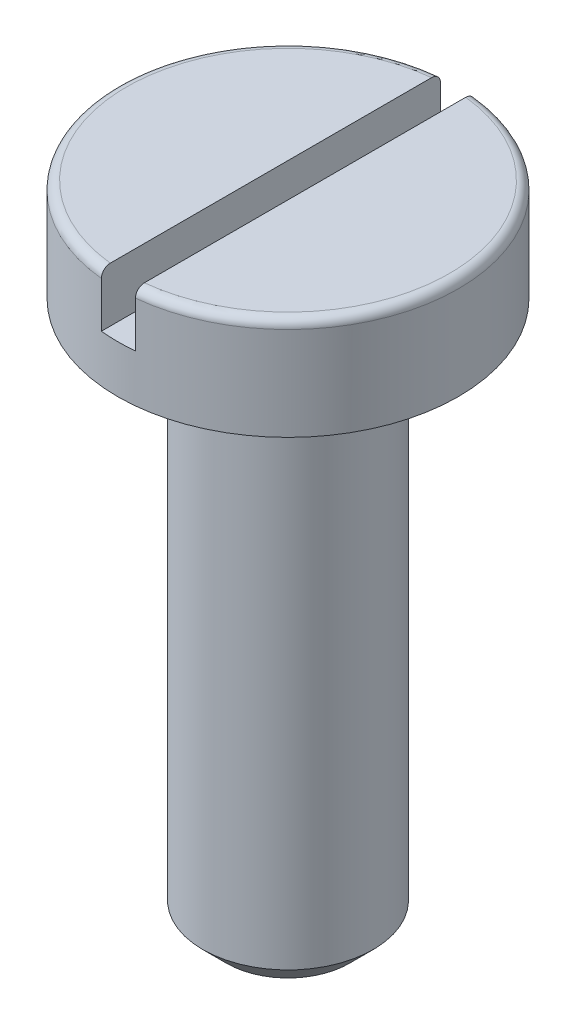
ISO-10303-21;
HEADER;
FILE_DESCRIPTION(('STEP AP214'),'2;1');
FILE_NAME('part.step','',(''),(''),'','','');
FILE_SCHEMA(('AUTOMOTIVE_DESIGN { 1 0 10303 214 1 1 1 1 }'));
ENDSEC;
DATA;
#1=APPLICATION_CONTEXT('core data for automotive mechanical design processes');
#2=APPLICATION_PROTOCOL_DEFINITION('international standard','automotive_design',2000,#1);
#3=PRODUCT_CONTEXT('',#1,'mechanical');
#4=PRODUCT('Part','Part','',(#3));
#5=PRODUCT_RELATED_PRODUCT_CATEGORY('part','',(#4));
#6=PRODUCT_DEFINITION_FORMATION('','',#4);
#7=PRODUCT_DEFINITION_CONTEXT('part definition',#1,'design');
#8=PRODUCT_DEFINITION('design','',#6,#7);
#9=PRODUCT_DEFINITION_SHAPE('','',#8);
#10=(LENGTH_UNIT() NAMED_UNIT(*) SI_UNIT(.MILLI.,.METRE.));
#11=(NAMED_UNIT(*) PLANE_ANGLE_UNIT() SI_UNIT($,.RADIAN.));
#12=(NAMED_UNIT(*) SI_UNIT($,.STERADIAN.) SOLID_ANGLE_UNIT());
#13=UNCERTAINTY_MEASURE_WITH_UNIT(LENGTH_MEASURE(1.E-05),#10,'distance_accuracy_value','');
#14=(GEOMETRIC_REPRESENTATION_CONTEXT(3) GLOBAL_UNCERTAINTY_ASSIGNED_CONTEXT((#13)) GLOBAL_UNIT_ASSIGNED_CONTEXT((#10,
#11,#12)) REPRESENTATION_CONTEXT('',''));
#15=CARTESIAN_POINT('',(0.,0.,0.));
#16=DIRECTION('',(0.,0.,1.));
#17=DIRECTION('',(1.,0.,0.));
#18=AXIS2_PLACEMENT_3D('',#15,#16,#17);
#19=CARTESIAN_POINT('',(0.,1.5,0.));
#20=DIRECTION('',(0.,-1.,0.));
#21=DIRECTION('',(0.,0.,-1.));
#22=AXIS2_PLACEMENT_3D('',#19,#20,#21);
#23=PLANE('',#22);
#24=CARTESIAN_POINT('',(0.,1.5,0.));
#25=DIRECTION('',(0.,1.,0.));
#26=DIRECTION('',(0.,0.,1.));
#27=AXIS2_PLACEMENT_3D('',#24,#25,#26);
#28=CIRCLE('',#27,2.37);
#29=CARTESIAN_POINT('',(-0.25,1.5,-2.35677746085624));
#30=VERTEX_POINT('',#29);
#31=CARTESIAN_POINT('',(-0.25,1.5,2.35677746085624));
#32=VERTEX_POINT('',#31);
#33=EDGE_CURVE('E96',#30,#32,#28,.T.);
#34=ORIENTED_EDGE('',*,*,#33,.T.);
#35=DIRECTION('',(0.,0.,1.));
#36=VECTOR('',#35,1.);
#37=CARTESIAN_POINT('',(-0.25,1.5,-2.5));
#38=LINE('',#37,#36);
#39=EDGE_CURVE('E87',#30,#32,#38,.T.);
#40=ORIENTED_EDGE('',*,*,#39,.F.);
#41=EDGE_LOOP('',(#34,#40));
#42=FACE_BOUND('',#41,.T.);
#43=ADVANCED_FACE('F33',(#42),#23,.F.);
#44=CARTESIAN_POINT('',(0.,1.37,0.));
#45=DIRECTION('',(0.,1.,0.));
#46=DIRECTION('',(0.,0.,1.));
#47=AXIS2_PLACEMENT_3D('',#44,#45,#46);
#48=TOROIDAL_SURFACE('',#47,2.37,0.13);
#49=ORIENTED_EDGE('',*,*,#33,.F.);
#50=CARTESIAN_POINT('',(-0.25,1.43911937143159,-2.46746982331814));
#51=CARTESIAN_POINT('',(-0.25,1.43296494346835,-2.47135281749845));
#52=CARTESIAN_POINT('',(-0.25,1.42647907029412,-2.47472015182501));
#53=CARTESIAN_POINT('',(-0.25,1.41302891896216,-2.48032132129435));
#54=CARTESIAN_POINT('',(-0.25,1.40606409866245,-2.4825538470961));
#55=CARTESIAN_POINT('',(-0.25,1.39186015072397,-2.48581591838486));
#56=CARTESIAN_POINT('',(-0.25,1.38462112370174,-2.48684590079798));
#57=CARTESIAN_POINT('',(-0.25,1.37007485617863,-2.48767352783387));
#58=CARTESIAN_POINT('',(-0.25,1.36276763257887,-2.48747147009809));
#59=CARTESIAN_POINT('',(-0.25,1.34830107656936,-2.48584291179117));
#60=CARTESIAN_POINT('',(-0.25,1.34114155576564,-2.48441808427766));
#61=CARTESIAN_POINT('',(-0.25,1.32716277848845,-2.48038766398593));
#62=CARTESIAN_POINT('',(-0.25,1.32034353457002,-2.47778202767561));
#63=CARTESIAN_POINT('',(-0.25,1.30723188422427,-2.47146272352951));
#64=CARTESIAN_POINT('',(-0.25,1.30093995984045,-2.46774805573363));
#65=CARTESIAN_POINT('',(-0.25,1.28906611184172,-2.45931875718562));
#66=CARTESIAN_POINT('',(-0.25,1.2834841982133,-2.45460411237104));
#67=CARTESIAN_POINT('',(-0.25,1.27316640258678,-2.44429081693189));
#68=CARTESIAN_POINT('',(-0.25,1.26843369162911,-2.43868899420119));
#69=CARTESIAN_POINT('',(-0.25,1.25997030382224,-2.4267736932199));
#70=CARTESIAN_POINT('',(-0.25,1.25623965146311,-2.42046019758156));
#71=CARTESIAN_POINT('',(-0.25,1.24986634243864,-2.40726673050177));
#72=CARTESIAN_POINT('',(-0.25,1.24722926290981,-2.40038406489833));
#73=CARTESIAN_POINT('',(-0.25,1.24314226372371,-2.38627484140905));
#74=CARTESIAN_POINT('',(-0.25,1.24169237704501,-2.37904827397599));
#75=CARTESIAN_POINT('',(-0.25,1.24001521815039,-2.36442203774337));
#76=CARTESIAN_POINT('',(-0.25,1.23979340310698,-2.35702174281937));
#77=CARTESIAN_POINT('',(-0.25,1.24059274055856,-2.34228852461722));
#78=CARTESIAN_POINT('',(-0.25,1.24161391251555,-2.33495560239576));
#79=CARTESIAN_POINT('',(-0.25,1.24487407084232,-2.32055094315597));
#80=CARTESIAN_POINT('',(-0.25,1.24711535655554,-2.31347972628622));
#81=CARTESIAN_POINT('',(-0.25,1.2527552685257,-2.29981484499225));
#82=CARTESIAN_POINT('',(-0.25,1.25615389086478,-2.2932211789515));
#83=CARTESIAN_POINT('',(-0.25,1.26400708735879,-2.28071187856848));
#84=CARTESIAN_POINT('',(-0.25,1.26845980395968,-2.27479507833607));
#85=CARTESIAN_POINT('',(-0.25,1.27829987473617,-2.26379762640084));
#86=CARTESIAN_POINT('',(-0.25,1.28368720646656,-2.25871695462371));
#87=CARTESIAN_POINT('',(-0.25,1.2952158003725,-2.24956319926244));
#88=CARTESIAN_POINT('',(-0.25,1.30135323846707,-2.24548529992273));
#89=CARTESIAN_POINT('',(-0.25,1.31422883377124,-2.23842492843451));
#90=CARTESIAN_POINT('',(-0.25,1.32096697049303,-2.23544241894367));
#91=CARTESIAN_POINT('',(-0.25,1.3348099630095,-2.23067557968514));
#92=CARTESIAN_POINT('',(-0.25,1.34191242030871,-2.22888428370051));
#93=CARTESIAN_POINT('',(-0.25,1.3563176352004,-2.22652489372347));
#94=CARTESIAN_POINT('',(-0.25,1.36362038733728,-2.22595676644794));
#95=CARTESIAN_POINT('',(-0.25,1.37818766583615,-2.22606033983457));
#96=CARTESIAN_POINT('',(-0.25,1.38545222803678,-2.22672707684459));
#97=CARTESIAN_POINT('',(-0.25,1.39976615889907,-2.22927090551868));
#98=CARTESIAN_POINT('',(-0.25,1.40681552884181,-2.23114798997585));
#99=CARTESIAN_POINT('',(-0.25,1.42049920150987,-2.23605713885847));
#100=CARTESIAN_POINT('',(-0.25,1.42713353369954,-2.23908912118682));
#101=CARTESIAN_POINT('',(-0.25,1.43980169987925,-2.24621970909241));
#102=CARTESIAN_POINT('',(-0.25,1.44583552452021,-2.25031833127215));
#103=CARTESIAN_POINT('',(-0.25,1.45715719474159,-2.25948194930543));
#104=CARTESIAN_POINT('',(-0.25,1.46244205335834,-2.26455063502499));
#105=CARTESIAN_POINT('',(-0.25,1.4720918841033,-2.27549874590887));
#106=CARTESIAN_POINT('',(-0.25,1.47645682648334,-2.28137819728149));
#107=CARTESIAN_POINT('',(-0.25,1.48416996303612,-2.29381777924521));
#108=CARTESIAN_POINT('',(-0.25,1.48751205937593,-2.30038169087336));
#109=CARTESIAN_POINT('',(-0.25,1.49305316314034,-2.31397547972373));
#110=CARTESIAN_POINT('',(-0.25,1.49525213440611,-2.32100537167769));
#111=CARTESIAN_POINT('',(-0.25,1.498454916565,-2.33536951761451));
#112=CARTESIAN_POINT('',(-0.25,1.49945266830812,-2.34270512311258));
#113=CARTESIAN_POINT('',(-0.25,1.50020513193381,-2.357439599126));
#114=CARTESIAN_POINT('',(-0.25,1.49995987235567,-2.36483846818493));
#115=CARTESIAN_POINT('',(-0.25,1.49823112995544,-2.37950421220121));
#116=CARTESIAN_POINT('',(-0.25,1.4967453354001,-2.38677081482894));
#117=CARTESIAN_POINT('',(-0.25,1.49257232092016,-2.40095268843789));
#118=CARTESIAN_POINT('',(-0.25,1.48988480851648,-2.40786787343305));
#119=CARTESIAN_POINT('',(-0.25,1.48338728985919,-2.42113804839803));
#120=CARTESIAN_POINT('',(-0.25,1.47957864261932,-2.42749370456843));
#121=CARTESIAN_POINT('',(-0.25,1.47094630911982,-2.43946569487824));
#122=CARTESIAN_POINT('',(-0.25,1.46612387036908,-2.44508292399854));
#123=CARTESIAN_POINT('',(-0.25,1.45756075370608,-2.45349644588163));
#124=CARTESIAN_POINT('',(-0.25,1.45408360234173,-2.45656555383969));
#125=CARTESIAN_POINT('',(-0.25,1.44682221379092,-2.46231606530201));
#126=CARTESIAN_POINT('',(-0.25,1.44303797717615,-2.464997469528));
#127=CARTESIAN_POINT('',(-0.25,1.43911937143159,-2.46746982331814));
#128=B_SPLINE_CURVE_WITH_KNOTS('',3,(#50,#51,#52,#53,#54,#55,#56,#57,#58,#59,#60,#61,#62,#63,
#64,#65,#66,#67,#68,#69,#70,#71,#72,#73,#74,#75,#76,#77,#78,#79,#80,#81,#82,#83,#84,#85,#86,#87,
#88,#89,#90,#91,#92,#93,#94,#95,#96,#97,#98,#99,#100,#101,#102,#103,#104,#105,#106,#107,#108,
#109,#110,#111,#112,#113,#114,#115,#116,#117,#118,#119,#120,#121,#122,#123,#124,#125,#126,#127),
.UNSPECIFIED.,.T.,.F.,(4,2,2,2,2,2,2,2,2,2,2,2,2,2,2,2,2,2,2,2,2,2,2,2,2,2,2,2,2,2,2,2,2,2,2,2,
2,2,4),(0.,0.0218141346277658,0.0436533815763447,0.0654846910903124,0.0873107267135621,
0.109106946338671,0.130903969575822,0.152720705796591,0.174537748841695,0.196434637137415,
0.218332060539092,0.240339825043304,0.262348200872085,0.284454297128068,0.306560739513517,
0.328708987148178,0.350857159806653,0.372966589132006,0.395075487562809,0.417076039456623,
0.439075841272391,0.460945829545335,0.482815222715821,0.504596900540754,0.526378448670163,
0.548158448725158,0.569938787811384,0.591803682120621,0.613669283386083,0.635662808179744,
0.65765702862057,0.679761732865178,0.70186592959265,0.724011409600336,0.746162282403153,
0.768286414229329,0.790383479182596,0.804272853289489,0.818162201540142),.UNSPECIFIED.);
#129=CARTESIAN_POINT('',(-0.25,1.36999999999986,-2.48746859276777));
#130=VERTEX_POINT('',#129);
#131=EDGE_CURVE('E84',#30,#130,#128,.T.);
#132=ORIENTED_EDGE('',*,*,#131,.T.);
#133=CARTESIAN_POINT('',(0.,1.37,0.));
#134=DIRECTION('',(0.,1.,0.));
#135=DIRECTION('',(0.,0.,1.));
#136=AXIS2_PLACEMENT_3D('',#133,#134,#135);
#137=CIRCLE('',#136,2.5);
#138=CARTESIAN_POINT('',(-0.25,1.37000000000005,2.48746859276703));
#139=VERTEX_POINT('',#138);
#140=EDGE_CURVE('E103',#130,#139,#137,.T.);
#141=ORIENTED_EDGE('',*,*,#140,.T.);
#142=CARTESIAN_POINT('',(-0.25,1.42827001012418,2.23988223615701));
#143=CARTESIAN_POINT('',(-0.25,1.42178303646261,2.23660967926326));
#144=CARTESIAN_POINT('',(-0.25,1.41501584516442,2.23388116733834));
#145=CARTESIAN_POINT('',(-0.25,1.40111402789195,2.22959648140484));
#146=CARTESIAN_POINT('',(-0.25,1.39397899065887,2.2280416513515));
#147=CARTESIAN_POINT('',(-0.25,1.37955103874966,2.22615388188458));
#148=CARTESIAN_POINT('',(-0.25,1.37225818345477,2.22582049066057));
#149=CARTESIAN_POINT('',(-0.25,1.35772216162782,2.22638464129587));
#150=CARTESIAN_POINT('',(-0.25,1.35047898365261,2.22728188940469));
#151=CARTESIAN_POINT('',(-0.25,1.33625385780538,2.23027853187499));
#152=CARTESIAN_POINT('',(-0.25,1.32927164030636,2.23237664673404));
#153=CARTESIAN_POINT('',(-0.25,1.31575706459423,2.23771263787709));
#154=CARTESIAN_POINT('',(-0.25,1.30922472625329,2.24095056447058));
#155=CARTESIAN_POINT('',(-0.25,1.2967779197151,2.24848114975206));
#156=CARTESIAN_POINT('',(-0.25,1.29086497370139,2.25277632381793));
#157=CARTESIAN_POINT('',(-0.25,1.27983920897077,2.2622934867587));
#158=CARTESIAN_POINT('',(-0.25,1.27472641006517,2.26751549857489));
#159=CARTESIAN_POINT('',(-0.25,1.26541640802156,2.27876789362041));
#160=CARTESIAN_POINT('',(-0.25,1.26122427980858,2.28480247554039));
#161=CARTESIAN_POINT('',(-0.25,1.25390591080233,2.29748658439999));
#162=CARTESIAN_POINT('',(-0.25,1.25077970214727,2.30413612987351));
#163=CARTESIAN_POINT('',(-0.25,1.24566392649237,2.31790205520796));
#164=CARTESIAN_POINT('',(-0.25,1.24368091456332,2.32502087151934));
#165=CARTESIAN_POINT('',(-0.25,1.24093365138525,2.33948996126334));
#166=CARTESIAN_POINT('',(-0.25,1.2401694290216,2.34684024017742));
#167=CARTESIAN_POINT('',(-0.25,1.2398805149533,2.36159008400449));
#168=CARTESIAN_POINT('',(-0.25,1.24036001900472,2.36898973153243));
#169=CARTESIAN_POINT('',(-0.25,1.24255472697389,2.3836035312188));
#170=CARTESIAN_POINT('',(-0.25,1.24426993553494,2.39081768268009));
#171=CARTESIAN_POINT('',(-0.25,1.24888858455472,2.40485327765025));
#172=CARTESIAN_POINT('',(-0.25,1.25179174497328,2.41167481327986));
#173=CARTESIAN_POINT('',(-0.25,1.25870596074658,2.4247312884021));
#174=CARTESIAN_POINT('',(-0.25,1.26271699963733,2.43096623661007));
#175=CARTESIAN_POINT('',(-0.25,1.27171897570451,2.44264879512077));
#176=CARTESIAN_POINT('',(-0.25,1.27670646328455,2.448099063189));
#177=CARTESIAN_POINT('',(-0.25,1.28752981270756,2.45807967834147));
#178=CARTESIAN_POINT('',(-0.25,1.29336565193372,2.46261004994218));
#179=CARTESIAN_POINT('',(-0.25,1.30568850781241,2.47059795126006));
#180=CARTESIAN_POINT('',(-0.25,1.31217209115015,2.47406077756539));
#181=CARTESIAN_POINT('',(-0.25,1.32563049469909,2.47984309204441));
#182=CARTESIAN_POINT('',(-0.25,1.33260530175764,2.48216261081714));
#183=CARTESIAN_POINT('',(-0.25,1.34681431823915,2.48558233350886));
#184=CARTESIAN_POINT('',(-0.25,1.35404721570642,2.48668799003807));
#185=CARTESIAN_POINT('',(-0.25,1.36859587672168,2.48766627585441));
#186=CARTESIAN_POINT('',(-0.25,1.37591163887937,2.48753892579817));
#187=CARTESIAN_POINT('',(-0.25,1.39040100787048,2.48605665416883));
#188=CARTESIAN_POINT('',(-0.25,1.39757489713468,2.48470449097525));
#189=CARTESIAN_POINT('',(-0.25,1.41159411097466,2.48081590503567));
#190=CARTESIAN_POINT('',(-0.25,1.41843943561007,2.47827948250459));
#191=CARTESIAN_POINT('',(-0.25,1.43161392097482,2.47209342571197));
#192=CARTESIAN_POINT('',(-0.25,1.43794264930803,2.46844287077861));
#193=CARTESIAN_POINT('',(-0.25,1.44990025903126,2.46013466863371));
#194=CARTESIAN_POINT('',(-0.25,1.4555291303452,2.45547700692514));
#195=CARTESIAN_POINT('',(-0.25,1.4659494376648,2.44526952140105));
#196=CARTESIAN_POINT('',(-0.25,1.47073779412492,2.43971655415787));
#197=CARTESIAN_POINT('',(-0.25,1.47931984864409,2.42788895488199));
#198=CARTESIAN_POINT('',(-0.25,1.4831135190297,2.42161430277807));
#199=CARTESIAN_POINT('',(-0.25,1.48961873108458,2.40848775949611));
#200=CARTESIAN_POINT('',(-0.25,1.49232474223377,2.40163312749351));
#201=CARTESIAN_POINT('',(-0.25,1.49655338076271,2.38756806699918));
#202=CARTESIAN_POINT('',(-0.25,1.49807597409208,2.38035762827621));
#203=CARTESIAN_POINT('',(-0.25,1.49990072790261,2.36575085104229));
#204=CARTESIAN_POINT('',(-0.25,1.50019735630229,2.35835382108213));
#205=CARTESIAN_POINT('',(-0.25,1.49954724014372,2.34361481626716));
#206=CARTESIAN_POINT('',(-0.25,1.49860052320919,2.33627284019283));
#207=CARTESIAN_POINT('',(-0.25,1.49548711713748,2.32183769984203));
#208=CARTESIAN_POINT('',(-0.25,1.49331813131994,2.31474503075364));
#209=CARTESIAN_POINT('',(-0.25,1.48781759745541,2.30102344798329));
#210=CARTESIAN_POINT('',(-0.25,1.48448576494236,2.29439464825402));
#211=CARTESIAN_POINT('',(-0.25,1.47675756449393,2.28180103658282));
#212=CARTESIAN_POINT('',(-0.25,1.47236243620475,2.27583546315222));
#213=CARTESIAN_POINT('',(-0.25,1.46263145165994,2.26473715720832));
#214=CARTESIAN_POINT('',(-0.25,1.45729675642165,2.25960341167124));
#215=CARTESIAN_POINT('',(-0.25,1.44797002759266,2.25204072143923));
#216=CARTESIAN_POINT('',(-0.25,1.44421445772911,2.24931504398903));
#217=CARTESIAN_POINT('',(-0.25,1.43643395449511,2.24427982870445));
#218=CARTESIAN_POINT('',(-0.25,1.43240902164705,2.24197029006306));
#219=CARTESIAN_POINT('',(-0.25,1.42827001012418,2.23988223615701));
#220=B_SPLINE_CURVE_WITH_KNOTS('',3,(#142,#143,#144,#145,#146,#147,#148,#149,#150,#151,#152,
#153,#154,#155,#156,#157,#158,#159,#160,#161,#162,#163,#164,#165,#166,#167,#168,#169,#170,#171,
#172,#173,#174,#175,#176,#177,#178,#179,#180,#181,#182,#183,#184,#185,#186,#187,#188,#189,#190,
#191,#192,#193,#194,#195,#196,#197,#198,#199,#200,#201,#202,#203,#204,#205,#206,#207,#208,#209,
#210,#211,#212,#213,#214,#215,#216,#217,#218,#219),.UNSPECIFIED.,.T.,.F.,(4,2,2,2,2,2,2,2,2,2,2,
2,2,2,2,2,2,2,2,2,2,2,2,2,2,2,2,2,2,2,2,2,2,2,2,2,2,2,4),(0.,0.0217802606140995,
0.0435854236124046,0.0653825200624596,0.0871744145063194,0.108943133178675,0.130712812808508,
0.152534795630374,0.17435731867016,0.196297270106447,0.218237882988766,0.240303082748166,
0.262368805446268,0.284509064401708,0.306649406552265,0.328784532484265,0.350919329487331,
0.372977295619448,0.395034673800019,0.416980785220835,0.438926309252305,0.460772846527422,
0.48261901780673,0.504416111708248,0.526213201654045,0.548028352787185,0.569843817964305,
0.591737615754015,0.61363202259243,0.635636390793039,0.657641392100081,0.679745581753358,
0.701849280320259,0.723994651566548,0.746145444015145,0.76827053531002,0.790368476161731,
0.804265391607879,0.818162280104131),.UNSPECIFIED.);
#221=EDGE_CURVE('E93',#139,#32,#220,.T.);
#222=ORIENTED_EDGE('',*,*,#221,.T.);
#223=EDGE_LOOP('',(#49,#132,#141,#222));
#224=FACE_BOUND('',#223,.T.);
#225=ADVANCED_FACE('F99',(#224),#48,.T.);
#226=CARTESIAN_POINT('',(0.,-8.,0.));
#227=DIRECTION('',(0.,1.,0.));
#228=DIRECTION('',(0.,0.,1.));
#229=AXIS2_PLACEMENT_3D('',#226,#227,#228);
#230=CYLINDRICAL_SURFACE('',#229,1.25);
#231=CARTESIAN_POINT('',(0.,-7.64999999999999,0.));
#232=DIRECTION('',(0.,1.,0.));
#233=DIRECTION('',(0.,0.,1.));
#234=AXIS2_PLACEMENT_3D('',#231,#232,#233);
#235=CIRCLE('',#234,1.25);
#236=CARTESIAN_POINT('',(0.,-7.64999999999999,1.25));
#237=VERTEX_POINT('',#236);
#238=EDGE_CURVE('E116',#237,#237,#235,.T.);
#239=ORIENTED_EDGE('',*,*,#238,.T.);
#240=EDGE_LOOP('',(#239));
#241=FACE_BOUND('',#240,.T.);
#242=CARTESIAN_POINT('',(0.,0.,0.));
#243=DIRECTION('',(0.,1.,0.));
#244=DIRECTION('',(0.,0.,1.));
#245=AXIS2_PLACEMENT_3D('',#242,#243,#244);
#246=CIRCLE('',#245,1.25);
#247=CARTESIAN_POINT('',(0.,0.,1.25));
#248=VERTEX_POINT('',#247);
#249=EDGE_CURVE('E113',#248,#248,#246,.T.);
#250=ORIENTED_EDGE('',*,*,#249,.F.);
#251=EDGE_LOOP('',(#250));
#252=FACE_BOUND('',#251,.T.);
#253=ADVANCED_FACE('F184',(#241,#252),#230,.T.);
#254=CARTESIAN_POINT('',(0.,-8.,0.));
#255=DIRECTION('',(0.,1.,0.));
#256=DIRECTION('',(0.,0.,1.));
#257=AXIS2_PLACEMENT_3D('',#254,#255,#256);
#258=PLANE('',#257);
#259=CARTESIAN_POINT('',(0.,-8.,0.));
#260=DIRECTION('',(0.,1.,0.));
#261=DIRECTION('',(0.,0.,1.));
#262=AXIS2_PLACEMENT_3D('',#259,#260,#261);
#263=CIRCLE('',#262,0.899999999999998);
#264=CARTESIAN_POINT('',(0.,-8.,0.899999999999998));
#265=VERTEX_POINT('',#264);
#266=EDGE_CURVE('E119',#265,#265,#263,.F.);
#267=ORIENTED_EDGE('',*,*,#266,.T.);
#268=EDGE_LOOP('',(#267));
#269=FACE_BOUND('',#268,.T.);
#270=ADVANCED_FACE('F194',(#269),#258,.F.);
#271=CARTESIAN_POINT('',(0.,-7.64999999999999,0.));
#272=DIRECTION('',(0.,1.,0.));
#273=DIRECTION('',(0.,0.,1.));
#274=AXIS2_PLACEMENT_3D('',#271,#272,#273);
#275=CONICAL_SURFACE('',#274,1.25,0.785398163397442);
#276=ORIENTED_EDGE('',*,*,#266,.F.);
#277=EDGE_LOOP('',(#276));
#278=FACE_BOUND('',#277,.T.);
#279=ORIENTED_EDGE('',*,*,#238,.F.);
#280=EDGE_LOOP('',(#279));
#281=FACE_BOUND('',#280,.T.);
#282=ADVANCED_FACE('F35',(#278,#281),#275,.T.);
#283=CARTESIAN_POINT('',(0.25,1.5,2.35677746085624));
#284=VERTEX_POINT('',#283);
#285=CARTESIAN_POINT('',(0.25,1.5,-2.35677746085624));
#286=VERTEX_POINT('',#285);
#287=EDGE_CURVE('E100',#284,#286,#28,.T.);
#288=ORIENTED_EDGE('',*,*,#287,.T.);
#289=DIRECTION('',(0.,0.,-1.));
#290=VECTOR('',#289,1.);
#291=CARTESIAN_POINT('',(0.25,1.5,-2.5));
#292=LINE('',#291,#290);
#293=EDGE_CURVE('E97',#284,#286,#292,.T.);
#294=ORIENTED_EDGE('',*,*,#293,.F.);
#295=EDGE_LOOP('',(#288,#294));
#296=FACE_BOUND('',#295,.T.);
#297=ADVANCED_FACE('F158',(#296),#23,.F.);
#298=CARTESIAN_POINT('',(0.,0.,0.));
#299=DIRECTION('',(0.,1.,0.));
#300=DIRECTION('',(0.,0.,1.));
#301=AXIS2_PLACEMENT_3D('',#298,#299,#300);
#302=PLANE('',#301);
#303=ORIENTED_EDGE('',*,*,#249,.T.);
#304=EDGE_LOOP('',(#303));
#305=FACE_BOUND('',#304,.T.);
#306=CARTESIAN_POINT('',(0.,0.,0.));
#307=DIRECTION('',(0.,1.,0.));
#308=DIRECTION('',(0.,0.,1.));
#309=AXIS2_PLACEMENT_3D('',#306,#307,#308);
#310=CIRCLE('',#309,2.5);
#311=CARTESIAN_POINT('',(0.,0.,2.5));
#312=VERTEX_POINT('',#311);
#313=EDGE_CURVE('E110',#312,#312,#310,.T.);
#314=ORIENTED_EDGE('',*,*,#313,.F.);
#315=EDGE_LOOP('',(#314));
#316=FACE_BOUND('',#315,.T.);
#317=ADVANCED_FACE('F188',(#305,#316),#302,.F.);
#318=CARTESIAN_POINT('',(0.,1.3,0.));
#319=DIRECTION('',(0.,1.,0.));
#320=DIRECTION('',(0.,0.,1.));
#321=AXIS2_PLACEMENT_3D('',#318,#319,#320);
#322=CYLINDRICAL_SURFACE('',#321,2.5);
#323=ORIENTED_EDGE('',*,*,#140,.F.);
#324=DIRECTION('',(0.,1.,0.));
#325=VECTOR('',#324,1.);
#326=CARTESIAN_POINT('',(-0.25,1.3,-2.48746859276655));
#327=LINE('',#326,#325);
#328=CARTESIAN_POINT('',(-0.25,0.7,-2.48746859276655));
#329=VERTEX_POINT('',#328);
#330=EDGE_CURVE('E56',#130,#329,#327,.F.);
#331=ORIENTED_EDGE('',*,*,#330,.T.);
#332=CARTESIAN_POINT('',(0.,0.7,0.));
#333=DIRECTION('',(0.,1.,0.));
#334=DIRECTION('',(0.,0.,1.));
#335=AXIS2_PLACEMENT_3D('',#332,#333,#334);
#336=CIRCLE('',#335,2.5);
#337=CARTESIAN_POINT('',(0.25,0.7,-2.48746859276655));
#338=VERTEX_POINT('',#337);
#339=EDGE_CURVE('E11',#338,#329,#336,.T.);
#340=ORIENTED_EDGE('',*,*,#339,.F.);
#341=DIRECTION('',(0.,1.,0.));
#342=VECTOR('',#341,1.);
#343=CARTESIAN_POINT('',(0.25,1.3,-2.48746859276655));
#344=LINE('',#343,#342);
#345=CARTESIAN_POINT('',(0.25,1.37,-2.48746859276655));
#346=VERTEX_POINT('',#345);
#347=EDGE_CURVE('E167',#338,#346,#344,.T.);
#348=ORIENTED_EDGE('',*,*,#347,.T.);
#349=CARTESIAN_POINT('',(0.25,1.37,2.48746859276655));
#350=VERTEX_POINT('',#349);
#351=EDGE_CURVE('E109',#350,#346,#137,.T.);
#352=ORIENTED_EDGE('',*,*,#351,.F.);
#353=DIRECTION('',(0.,1.,0.));
#354=VECTOR('',#353,1.);
#355=CARTESIAN_POINT('',(0.25,1.3,2.48746859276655));
#356=LINE('',#355,#354);
#357=CARTESIAN_POINT('',(0.25,0.7,2.48746859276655));
#358=VERTEX_POINT('',#357);
#359=EDGE_CURVE('E48',#350,#358,#356,.F.);
#360=ORIENTED_EDGE('',*,*,#359,.T.);
#361=CARTESIAN_POINT('',(-0.25,0.7,2.48746859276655));
#362=VERTEX_POINT('',#361);
#363=EDGE_CURVE('E37',#362,#358,#336,.T.);
#364=ORIENTED_EDGE('',*,*,#363,.F.);
#365=DIRECTION('',(0.,1.,0.));
#366=VECTOR('',#365,1.);
#367=CARTESIAN_POINT('',(-0.25,1.3,2.48746859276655));
#368=LINE('',#367,#366);
#369=EDGE_CURVE('E104',#362,#139,#368,.T.);
#370=ORIENTED_EDGE('',*,*,#369,.T.);
#371=EDGE_LOOP('',(#323,#331,#340,#348,#352,#360,#364,#370));
#372=FACE_BOUND('',#371,.T.);
#373=ORIENTED_EDGE('',*,*,#313,.T.);
#374=EDGE_LOOP('',(#373));
#375=FACE_BOUND('',#374,.T.);
#376=ADVANCED_FACE('F171',(#372,#375),#322,.T.);
#377=ORIENTED_EDGE('',*,*,#351,.T.);
#378=CARTESIAN_POINT('',(0.25,1.43911937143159,-2.46746982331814));
#379=CARTESIAN_POINT('',(0.25,1.44531290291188,-2.4635613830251));
#380=CARTESIAN_POINT('',(0.25,1.45117973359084,-2.45912493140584));
#381=CARTESIAN_POINT('',(0.25,1.46208885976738,-2.44932494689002));
#382=CARTESIAN_POINT('',(0.25,1.46713010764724,-2.44396025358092));
#383=CARTESIAN_POINT('',(0.25,1.47623837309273,-2.43246478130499));
#384=CARTESIAN_POINT('',(0.25,1.48030606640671,-2.42633453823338));
#385=CARTESIAN_POINT('',(0.25,1.48735776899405,-2.41348197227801));
#386=CARTESIAN_POINT('',(0.25,1.49034204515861,-2.40675979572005));
#387=CARTESIAN_POINT('',(0.25,1.49515638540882,-2.39288535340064));
#388=CARTESIAN_POINT('',(0.25,1.49698200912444,-2.38573154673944));
#389=CARTESIAN_POINT('',(0.25,1.49941139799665,-2.37121906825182));
#390=CARTESIAN_POINT('',(0.25,1.50001508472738,-2.36386038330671));
#391=CARTESIAN_POINT('',(0.25,1.49998428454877,-2.3491179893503));
#392=CARTESIAN_POINT('',(0.25,1.49934515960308,-2.34173428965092));
#393=CARTESIAN_POINT('',(0.25,1.49683735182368,-2.32717865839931));
#394=CARTESIAN_POINT('',(0.25,1.49496865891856,-2.3200067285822));
#395=CARTESIAN_POINT('',(0.25,1.490051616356,-2.3060736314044));
#396=CARTESIAN_POINT('',(0.25,1.48700245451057,-2.29931275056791));
#397=CARTESIAN_POINT('',(0.25,1.47980910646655,-2.28640093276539));
#398=CARTESIAN_POINT('',(0.25,1.47566493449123,-2.28024998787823));
#399=CARTESIAN_POINT('',(0.25,1.46641129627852,-2.26875323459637));
#400=CARTESIAN_POINT('',(0.25,1.46130474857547,-2.26340507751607));
#401=CARTESIAN_POINT('',(0.25,1.45026180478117,-2.25364782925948));
#402=CARTESIAN_POINT('',(0.25,1.44432543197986,-2.24923871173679));
#403=CARTESIAN_POINT('',(0.25,1.43182649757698,-2.24151111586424));
#404=CARTESIAN_POINT('',(0.25,1.42526759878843,-2.23818671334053));
#405=CARTESIAN_POINT('',(0.25,1.41168257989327,-2.23269332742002));
#406=CARTESIAN_POINT('',(0.25,1.40465647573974,-2.23052430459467));
#407=CARTESIAN_POINT('',(0.25,1.39037852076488,-2.22741492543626));
#408=CARTESIAN_POINT('',(0.25,1.38312814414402,-2.22646779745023));
#409=CARTESIAN_POINT('',(0.25,1.36857150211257,-2.22580800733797));
#410=CARTESIAN_POINT('',(0.25,1.36126523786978,-2.22609531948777));
#411=CARTESIAN_POINT('',(0.25,1.3468256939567,-2.22789329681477));
#412=CARTESIAN_POINT('',(0.25,1.33969198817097,-2.22940054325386));
#413=CARTESIAN_POINT('',(0.25,1.32577834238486,-2.23358966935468));
#414=CARTESIAN_POINT('',(0.25,1.3189984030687,-2.23627155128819));
#415=CARTESIAN_POINT('',(0.25,1.30597364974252,-2.24273619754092));
#416=CARTESIAN_POINT('',(0.25,1.29972960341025,-2.2465205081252));
#417=CARTESIAN_POINT('',(0.25,1.28796144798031,-2.25507891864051));
#418=CARTESIAN_POINT('',(0.25,1.28243735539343,-2.25985304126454));
#419=CARTESIAN_POINT('',(0.25,1.27223671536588,-2.27027985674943));
#420=CARTESIAN_POINT('',(0.25,1.26756441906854,-2.27593670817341));
#421=CARTESIAN_POINT('',(0.25,1.25922921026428,-2.2879506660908));
#422=CARTESIAN_POINT('',(0.25,1.25556632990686,-2.29430779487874));
#423=CARTESIAN_POINT('',(0.25,1.2493316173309,-2.30758200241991));
#424=CARTESIAN_POINT('',(0.25,1.24676632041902,-2.31450215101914));
#425=CARTESIAN_POINT('',(0.25,1.24282849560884,-2.32867390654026));
#426=CARTESIAN_POINT('',(0.25,1.24145599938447,-2.33592552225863));
#427=CARTESIAN_POINT('',(0.25,1.23993838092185,-2.3505865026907));
#428=CARTESIAN_POINT('',(0.25,1.23979835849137,-2.35799639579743));
#429=CARTESIAN_POINT('',(0.25,1.24076330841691,-2.37273473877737));
#430=CARTESIAN_POINT('',(0.25,1.24186829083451,-2.38006318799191));
#431=CARTESIAN_POINT('',(0.25,1.24529448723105,-2.39443552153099));
#432=CARTESIAN_POINT('',(0.25,1.24761653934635,-2.40147920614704));
#433=CARTESIAN_POINT('',(0.25,1.25341345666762,-2.41507516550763));
#434=CARTESIAN_POINT('',(0.25,1.25688831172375,-2.42162744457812));
#435=CARTESIAN_POINT('',(0.25,1.264882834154,-2.43403436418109));
#436=CARTESIAN_POINT('',(0.25,1.26939956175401,-2.43989089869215));
#437=CARTESIAN_POINT('',(0.25,1.27935653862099,-2.45075789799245));
#438=CARTESIAN_POINT('',(0.25,1.28479676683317,-2.4557683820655));
#439=CARTESIAN_POINT('',(0.25,1.29641830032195,-2.46477503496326));
#440=CARTESIAN_POINT('',(0.25,1.30259589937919,-2.46877598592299));
#441=CARTESIAN_POINT('',(0.25,1.3155374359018,-2.47567791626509));
#442=CARTESIAN_POINT('',(0.25,1.32230133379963,-2.47857896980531));
#443=CARTESIAN_POINT('',(0.25,1.33618770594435,-2.48318462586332));
#444=CARTESIAN_POINT('',(0.25,1.34330824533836,-2.48489506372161));
#445=CARTESIAN_POINT('',(0.25,1.35773763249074,-2.48709264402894));
#446=CARTESIAN_POINT('',(0.25,1.36504652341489,-2.48757950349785));
#447=CARTESIAN_POINT('',(0.25,1.37962324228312,-2.4873155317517));
#448=CARTESIAN_POINT('',(0.25,1.38689112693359,-2.48656772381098));
#449=CARTESIAN_POINT('',(0.25,1.40119172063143,-2.48386209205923));
#450=CARTESIAN_POINT('',(0.25,1.40822470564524,-2.48190574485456));
#451=CARTESIAN_POINT('',(0.25,1.41924547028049,-2.47781537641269));
#452=CARTESIAN_POINT('',(0.25,1.42336845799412,-2.4760359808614));
#453=CARTESIAN_POINT('',(0.25,1.43140829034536,-2.47206038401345));
#454=CARTESIAN_POINT('',(0.25,1.43532513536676,-2.46986418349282));
#455=CARTESIAN_POINT('',(0.25,1.43911937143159,-2.46746982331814));
#456=B_SPLINE_CURVE_WITH_KNOTS('',3,(#378,#379,#380,#381,#382,#383,#384,#385,#386,#387,#388,
#389,#390,#391,#392,#393,#394,#395,#396,#397,#398,#399,#400,#401,#402,#403,#404,#405,#406,#407,
#408,#409,#410,#411,#412,#413,#414,#415,#416,#417,#418,#419,#420,#421,#422,#423,#424,#425,#426,
#427,#428,#429,#430,#431,#432,#433,#434,#435,#436,#437,#438,#439,#440,#441,#442,#443,#444,#445,
#446,#447,#448,#449,#450,#451,#452,#453,#454,#455),.UNSPECIFIED.,.T.,.F.,(4,2,2,2,2,2,2,2,2,2,2,
2,2,2,2,2,2,2,2,2,2,2,2,2,2,2,2,2,2,2,2,2,2,2,2,2,2,2,4),(0.,0.0219544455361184,
0.0439365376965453,0.0659033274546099,0.0878647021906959,0.109909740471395,0.131956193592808,
0.154085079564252,0.176214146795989,0.19835846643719,0.22050249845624,0.242580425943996,
0.264657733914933,0.286612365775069,0.308566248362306,0.330397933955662,0.352229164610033,
0.373999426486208,0.395769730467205,0.417570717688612,0.43937220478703,0.461279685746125,
0.483187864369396,0.505224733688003,0.527262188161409,0.549390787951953,0.571519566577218,
0.593663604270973,0.615807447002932,0.637889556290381,0.659971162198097,0.681946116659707,
0.703919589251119,0.725784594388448,0.747654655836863,0.769471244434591,0.791261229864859,
0.804710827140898,0.818160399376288),.UNSPECIFIED.);
#457=EDGE_CURVE('E128',#346,#286,#456,.T.);
#458=ORIENTED_EDGE('',*,*,#457,.T.);
#459=ORIENTED_EDGE('',*,*,#287,.F.);
#460=CARTESIAN_POINT('',(0.25,1.42827001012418,2.23988223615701));
#461=CARTESIAN_POINT('',(0.25,1.43480328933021,2.24317888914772));
#462=CARTESIAN_POINT('',(0.25,1.44106182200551,2.24703226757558));
#463=CARTESIAN_POINT('',(0.25,1.45284696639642,2.25574000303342));
#464=CARTESIAN_POINT('',(0.25,1.45837264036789,2.2605956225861));
#465=CARTESIAN_POINT('',(0.25,1.4685279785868,2.27116134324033));
#466=CARTESIAN_POINT('',(0.25,1.47315829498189,2.27687081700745));
#467=CARTESIAN_POINT('',(0.25,1.48139817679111,2.28898159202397));
#468=CARTESIAN_POINT('',(0.25,1.48500799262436,2.2953827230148));
#469=CARTESIAN_POINT('',(0.25,1.49112338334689,2.30872636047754));
#470=CARTESIAN_POINT('',(0.25,1.49362405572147,2.31567111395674));
#471=CARTESIAN_POINT('',(0.25,1.49742942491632,2.3298812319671));
#472=CARTESIAN_POINT('',(0.25,1.49873404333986,2.33714661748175));
#473=CARTESIAN_POINT('',(0.25,1.50011402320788,2.35182294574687));
#474=CARTESIAN_POINT('',(0.25,1.50018439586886,2.35923435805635));
#475=CARTESIAN_POINT('',(0.25,1.49908074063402,2.37396400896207));
#476=CARTESIAN_POINT('',(0.25,1.49790670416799,2.38128224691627));
#477=CARTESIAN_POINT('',(0.25,1.4943450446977,2.39562189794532));
#478=CARTESIAN_POINT('',(0.25,1.49195670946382,2.4026431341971));
#479=CARTESIAN_POINT('',(0.25,1.48603186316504,2.416183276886));
#480=CARTESIAN_POINT('',(0.25,1.48249536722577,2.42270218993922));
#481=CARTESIAN_POINT('',(0.25,1.47438445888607,2.43503198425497));
#482=CARTESIAN_POINT('',(0.25,1.46981305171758,2.44084484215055));
#483=CARTESIAN_POINT('',(0.25,1.45975484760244,2.45161585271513));
#484=CARTESIAN_POINT('',(0.25,1.45426807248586,2.45657402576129));
#485=CARTESIAN_POINT('',(0.25,1.44256343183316,2.46546896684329));
#486=CARTESIAN_POINT('',(0.25,1.43634926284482,2.46941059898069));
#487=CARTESIAN_POINT('',(0.25,1.42334490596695,2.47618877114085));
#488=CARTESIAN_POINT('',(0.25,1.41655473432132,2.47902534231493));
#489=CARTESIAN_POINT('',(0.25,1.40262620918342,2.48349918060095));
#490=CARTESIAN_POINT('',(0.25,1.39548968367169,2.485142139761));
#491=CARTESIAN_POINT('',(0.25,1.38104190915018,2.4872027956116));
#492=CARTESIAN_POINT('',(0.25,1.37373066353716,2.48762051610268));
#493=CARTESIAN_POINT('',(0.25,1.35916318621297,2.48721905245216));
#494=CARTESIAN_POINT('',(0.25,1.35190685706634,2.48640339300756));
#495=CARTESIAN_POINT('',(0.25,1.33763417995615,2.48356551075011));
#496=CARTESIAN_POINT('',(0.25,1.33061783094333,2.48154329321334));
#497=CARTESIAN_POINT('',(0.25,1.31702265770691,2.4763508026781));
#498=CARTESIAN_POINT('',(0.25,1.31044389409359,2.47318037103));
#499=CARTESIAN_POINT('',(0.25,1.2979098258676,2.46578325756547));
#500=CARTESIAN_POINT('',(0.25,1.29195452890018,2.46155656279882));
#501=CARTESIAN_POINT('',(0.25,1.28081627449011,2.45215381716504));
#502=CARTESIAN_POINT('',(0.25,1.27563574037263,2.44697489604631));
#503=CARTESIAN_POINT('',(0.25,1.26621257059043,2.43582452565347));
#504=CARTESIAN_POINT('',(0.25,1.26196995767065,2.4298530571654));
#505=CARTESIAN_POINT('',(0.25,1.25452094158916,2.417256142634));
#506=CARTESIAN_POINT('',(0.25,1.25131967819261,2.41062765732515));
#507=CARTESIAN_POINT('',(0.25,1.24606935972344,2.39692908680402));
#508=CARTESIAN_POINT('',(0.25,1.24402033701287,2.38985898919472));
#509=CARTESIAN_POINT('',(0.25,1.24112311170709,2.37544159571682));
#510=CARTESIAN_POINT('',(0.25,1.24028070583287,2.36809313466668));
#511=CARTESIAN_POINT('',(0.25,1.23983791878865,2.35335884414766));
#512=CARTESIAN_POINT('',(0.25,1.24023756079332,2.3459730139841));
#513=CARTESIAN_POINT('',(0.25,1.24227036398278,2.33135279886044));
#514=CARTESIAN_POINT('',(0.25,1.24390682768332,2.32411887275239));
#515=CARTESIAN_POINT('',(0.25,1.24837191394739,2.31002868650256));
#516=CARTESIAN_POINT('',(0.25,1.25120054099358,2.30317242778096));
#517=CARTESIAN_POINT('',(0.25,1.25796880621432,2.29003909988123));
#518=CARTESIAN_POINT('',(0.25,1.26190753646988,2.28376156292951));
#519=CARTESIAN_POINT('',(0.25,1.27078722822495,2.27196046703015));
#520=CARTESIAN_POINT('',(0.25,1.27572817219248,2.26643689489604));
#521=CARTESIAN_POINT('',(0.25,1.28645035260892,2.25632637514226));
#522=CARTESIAN_POINT('',(0.25,1.29222793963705,2.25173555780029));
#523=CARTESIAN_POINT('',(0.25,1.3044754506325,2.24359610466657));
#524=CARTESIAN_POINT('',(0.25,1.31094532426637,2.24004739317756));
#525=CARTESIAN_POINT('',(0.25,1.32435209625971,2.2341150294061));
#526=CARTESIAN_POINT('',(0.25,1.33128594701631,2.23172448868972));
#527=CARTESIAN_POINT('',(0.25,1.34545952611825,2.22814716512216));
#528=CARTESIAN_POINT('',(0.25,1.35269932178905,2.22696064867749));
#529=CARTESIAN_POINT('',(0.25,1.36724346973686,2.22582979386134));
#530=CARTESIAN_POINT('',(0.25,1.37454741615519,2.22588019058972));
#531=CARTESIAN_POINT('',(0.25,1.38903647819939,2.22720915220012));
#532=CARTESIAN_POINT('',(0.25,1.39622172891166,2.2284862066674));
#533=CARTESIAN_POINT('',(0.25,1.40756582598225,2.23150514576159));
#534=CARTESIAN_POINT('',(0.25,1.41182600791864,2.23287947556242));
#535=CARTESIAN_POINT('',(0.25,1.4201816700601,2.23606063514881));
#536=CARTESIAN_POINT('',(0.25,1.42427715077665,2.23786746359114));
#537=CARTESIAN_POINT('',(0.25,1.42827001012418,2.23988223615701));
#538=B_SPLINE_CURVE_WITH_KNOTS('',3,(#460,#461,#462,#463,#464,#465,#466,#467,#468,#469,#470,
#471,#472,#473,#474,#475,#476,#477,#478,#479,#480,#481,#482,#483,#484,#485,#486,#487,#488,#489,
#490,#491,#492,#493,#494,#495,#496,#497,#498,#499,#500,#501,#502,#503,#504,#505,#506,#507,#508,
#509,#510,#511,#512,#513,#514,#515,#516,#517,#518,#519,#520,#521,#522,#523,#524,#525,#526,#527,
#528,#529,#530,#531,#532,#533,#534,#535,#536,#537),.UNSPECIFIED.,.T.,.F.,(4,2,2,2,2,2,2,2,2,2,2,
2,2,2,2,2,2,2,2,2,2,2,2,2,2,2,2,2,2,2,2,2,2,2,2,2,2,2,4),(0.,0.021937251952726,
0.0439023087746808,0.0658513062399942,0.0877949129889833,0.10983456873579,0.1318756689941,
0.15400583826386,0.176136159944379,0.198279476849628,0.220422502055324,0.242502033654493,
0.264581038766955,0.2865523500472,0.308523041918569,0.330388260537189,0.352253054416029,
0.374055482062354,0.395857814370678,0.417663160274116,0.439468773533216,0.461341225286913,
0.483214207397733,0.505193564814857,0.527173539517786,0.549258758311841,0.571344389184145,
0.593489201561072,0.615634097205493,0.637760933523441,0.659887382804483,0.681920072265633,
0.703951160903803,0.725849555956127,0.747752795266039,0.76956282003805,0.791346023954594,
0.804753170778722,0.818160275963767),.UNSPECIFIED.);
#539=EDGE_CURVE('E122',#284,#350,#538,.T.);
#540=ORIENTED_EDGE('',*,*,#539,.T.);
#541=EDGE_LOOP('',(#377,#458,#459,#540));
#542=FACE_BOUND('',#541,.T.);
#543=ADVANCED_FACE('F132',(#542),#48,.T.);
#544=CARTESIAN_POINT('',(-0.25,0.7,2.5));
#545=DIRECTION('',(0.,1.,0.));
#546=DIRECTION('',(0.,0.,1.));
#547=AXIS2_PLACEMENT_3D('',#544,#545,#546);
#548=PLANE('',#547);
#549=DIRECTION('',(0.,0.,-1.));
#550=VECTOR('',#549,1.);
#551=CARTESIAN_POINT('',(0.25,0.7,-2.5));
#552=LINE('',#551,#550);
#553=EDGE_CURVE('E162',#358,#338,#552,.T.);
#554=ORIENTED_EDGE('',*,*,#553,.T.);
#555=ORIENTED_EDGE('',*,*,#339,.T.);
#556=DIRECTION('',(0.,0.,1.));
#557=VECTOR('',#556,1.);
#558=CARTESIAN_POINT('',(-0.25,0.7,-2.5));
#559=LINE('',#558,#557);
#560=EDGE_CURVE('E159',#329,#362,#559,.T.);
#561=ORIENTED_EDGE('',*,*,#560,.T.);
#562=ORIENTED_EDGE('',*,*,#363,.T.);
#563=EDGE_LOOP('',(#554,#555,#561,#562));
#564=FACE_BOUND('',#563,.T.);
#565=ADVANCED_FACE('F140',(#564),#548,.T.);
#566=CARTESIAN_POINT('',(-0.25,0.7,-2.5));
#567=DIRECTION('',(-1.,0.,0.));
#568=DIRECTION('',(0.,0.,1.));
#569=AXIS2_PLACEMENT_3D('',#566,#567,#568);
#570=PLANE('',#569);
#571=ORIENTED_EDGE('',*,*,#131,.F.);
#572=ORIENTED_EDGE('',*,*,#39,.T.);
#573=ORIENTED_EDGE('',*,*,#221,.F.);
#574=ORIENTED_EDGE('',*,*,#369,.F.);
#575=ORIENTED_EDGE('',*,*,#560,.F.);
#576=ORIENTED_EDGE('',*,*,#330,.F.);
#577=EDGE_LOOP('',(#571,#572,#573,#574,#575,#576));
#578=FACE_BOUND('',#577,.T.);
#579=ADVANCED_FACE('F86',(#578),#570,.F.);
#580=CARTESIAN_POINT('',(0.25,0.7,-2.5));
#581=DIRECTION('',(1.,0.,0.));
#582=DIRECTION('',(0.,0.,-1.));
#583=AXIS2_PLACEMENT_3D('',#580,#581,#582);
#584=PLANE('',#583);
#585=ORIENTED_EDGE('',*,*,#553,.F.);
#586=ORIENTED_EDGE('',*,*,#359,.F.);
#587=ORIENTED_EDGE('',*,*,#539,.F.);
#588=ORIENTED_EDGE('',*,*,#293,.T.);
#589=ORIENTED_EDGE('',*,*,#457,.F.);
#590=ORIENTED_EDGE('',*,*,#347,.F.);
#591=EDGE_LOOP('',(#585,#586,#587,#588,#589,#590));
#592=FACE_BOUND('',#591,.T.);
#593=ADVANCED_FACE('F136',(#592),#584,.F.);
#594=CLOSED_SHELL('',(#43,#225,#253,#270,#282,#297,#317,#376,#543,#565,#579,#593));
#595=MANIFOLD_SOLID_BREP('B2',#594);
#596=ADVANCED_BREP_SHAPE_REPRESENTATION('',(#18,#595),#14);
#597=SHAPE_DEFINITION_REPRESENTATION(#9,#596);
ENDSEC;
END-ISO-10303-21;
